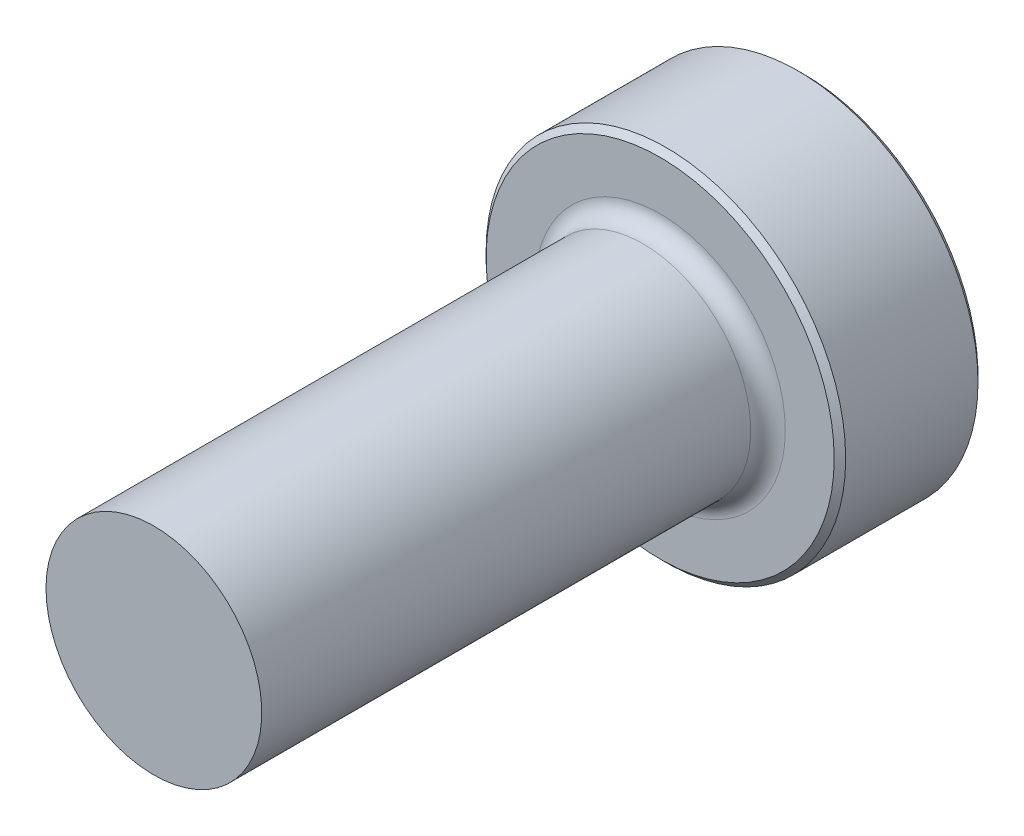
from build123d import *

# Parameters (mm, degrees)
CHAMFER1_SIZE = 0.254


with BuildPart() as part:
    # Sketch1 → Revolve1 (revolve)
    with BuildSketch(Plane(origin=(0, 0, 0), x_dir=(0, 0, -1), z_dir=(1, 0, 0)), mode=Mode.PRIVATE) as revolve1_sk:
        with BuildLine():
            Line((0, 0), (0, 7.9375))
            Line((0, 7.9375), (-6.35, 7.9375))
            Line((-6.35, 7.9375), (-6.35, 5.5245))
            ThreePointArc((-6.35, 5.5245), (-6.573184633, 4.985684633), (-7.112, 4.7625))
            Line((-7.112, 4.7625), (-28.702, 4.7625))
            Line((-28.702, 4.7625), (-28.702, 0))
            Line((-28.702, 0), (0, 0))
        make_face()
    revolve(revolve1_sk.sketch.rotate(Axis((0, 0, -25.434744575), (0, 0, 1)), 90), axis=Axis((0, 0, -25.434744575), (0, 0, 1)))

    # Chamfer1
    chamfer1_edges = [part.edges().sort_by_distance(p)[0] for p in [
        (7.9375, 0, 0),
        (7.9375, 0, 6.35),
    ]]
    chamfer(chamfer1_edges, length=CHAMFER1_SIZE)


solid = part.part
